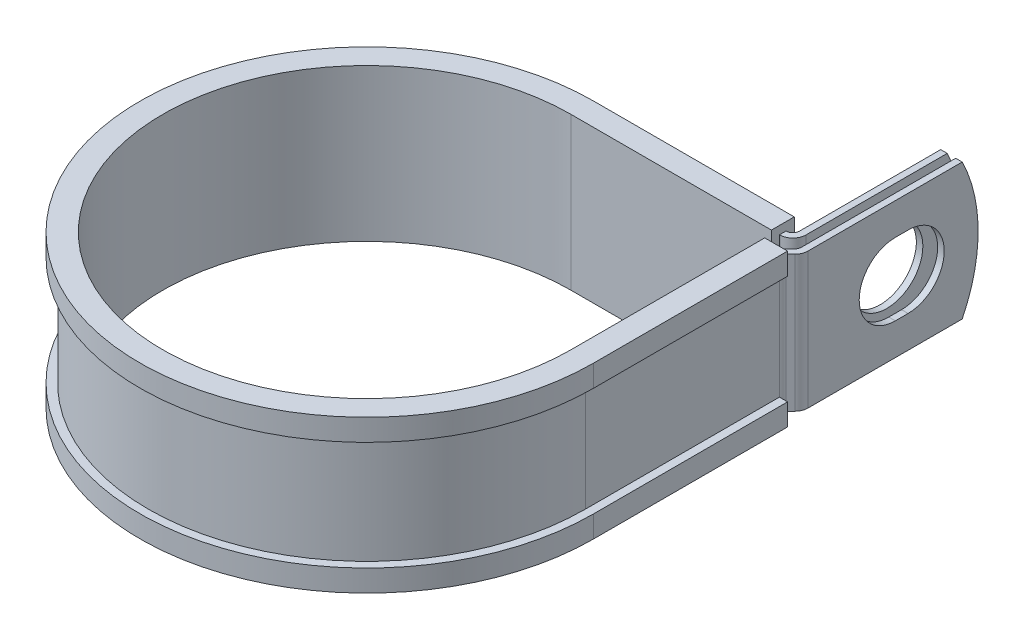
ISO-10303-21;
HEADER;
FILE_DESCRIPTION(('STEP AP214'),'2;1');
FILE_NAME('part.step','',(''),(''),'','','');
FILE_SCHEMA(('AUTOMOTIVE_DESIGN { 1 0 10303 214 1 1 1 1 }'));
ENDSEC;
DATA;
#1=APPLICATION_CONTEXT('core data for automotive mechanical design processes');
#2=APPLICATION_PROTOCOL_DEFINITION('international standard','automotive_design',2000,#1);
#3=PRODUCT_CONTEXT('',#1,'mechanical');
#4=PRODUCT('Part','Part','',(#3));
#5=PRODUCT_RELATED_PRODUCT_CATEGORY('part','',(#4));
#6=PRODUCT_DEFINITION_FORMATION('','',#4);
#7=PRODUCT_DEFINITION_CONTEXT('part definition',#1,'design');
#8=PRODUCT_DEFINITION('design','',#6,#7);
#9=PRODUCT_DEFINITION_SHAPE('','',#8);
#10=(LENGTH_UNIT() NAMED_UNIT(*) SI_UNIT(.MILLI.,.METRE.));
#11=(NAMED_UNIT(*) PLANE_ANGLE_UNIT() SI_UNIT($,.RADIAN.));
#12=(NAMED_UNIT(*) SI_UNIT($,.STERADIAN.) SOLID_ANGLE_UNIT());
#13=UNCERTAINTY_MEASURE_WITH_UNIT(LENGTH_MEASURE(1.E-05),#10,'distance_accuracy_value','');
#14=(GEOMETRIC_REPRESENTATION_CONTEXT(3) GLOBAL_UNCERTAINTY_ASSIGNED_CONTEXT((#13)) GLOBAL_UNIT_ASSIGNED_CONTEXT((#10,
#11,#12)) REPRESENTATION_CONTEXT('',''));
#15=CARTESIAN_POINT('',(0.,0.,0.));
#16=DIRECTION('',(0.,0.,1.));
#17=DIRECTION('',(1.,0.,0.));
#18=AXIS2_PLACEMENT_3D('',#15,#16,#17);
#19=CARTESIAN_POINT('',(40.3022698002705,-12.7,-39.624));
#20=DIRECTION('',(0.,1.,0.));
#21=DIRECTION('',(1.,0.,0.));
#22=AXIS2_PLACEMENT_3D('',#19,#20,#21);
#23=PLANE('',#22);
#24=DIRECTION('',(0.,0.,-1.));
#25=VECTOR('',#24,1.);
#26=CARTESIAN_POINT('',(37.457469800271,-12.7,-39.624));
#27=LINE('',#26,#25);
#28=CARTESIAN_POINT('',(37.457469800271,-12.7,-39.624));
#29=VERTEX_POINT('',#28);
#30=CARTESIAN_POINT('',(37.457469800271,-12.7,-40.8432));
#31=VERTEX_POINT('',#30);
#32=EDGE_CURVE('E524',#29,#31,#27,.T.);
#33=ORIENTED_EDGE('',*,*,#32,.T.);
#34=DIRECTION('',(1.,0.,0.));
#35=VECTOR('',#34,1.);
#36=CARTESIAN_POINT('',(0.,-12.7,-40.8432));
#37=LINE('',#36,#35);
#38=CARTESIAN_POINT('',(37.5082698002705,-12.7,-40.8432));
#39=VERTEX_POINT('',#38);
#40=EDGE_CURVE('E411',#39,#31,#37,.F.);
#41=ORIENTED_EDGE('',*,*,#40,.F.);
#42=CARTESIAN_POINT('',(37.5082698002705,-12.7,-42.0624));
#43=DIRECTION('',(0.,1.,0.));
#44=DIRECTION('',(1.,0.,0.));
#45=AXIS2_PLACEMENT_3D('',#42,#43,#44);
#46=CIRCLE('',#45,1.21919999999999);
#47=CARTESIAN_POINT('',(38.7274698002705,-12.7,-42.0624));
#48=VERTEX_POINT('',#47);
#49=EDGE_CURVE('E409',#48,#39,#46,.F.);
#50=ORIENTED_EDGE('',*,*,#49,.F.);
#51=DIRECTION('',(0.,0.,1.));
#52=VECTOR('',#51,1.);
#53=CARTESIAN_POINT('',(38.7274698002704,-12.7,-71.4248));
#54=LINE('',#53,#52);
#55=CARTESIAN_POINT('',(38.7274698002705,-12.7,-68.4474683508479));
#56=VERTEX_POINT('',#55);
#57=EDGE_CURVE('E407',#56,#48,#54,.T.);
#58=ORIENTED_EDGE('',*,*,#57,.F.);
#59=DIRECTION('',(-1.,0.,0.));
#60=VECTOR('',#59,1.);
#61=CARTESIAN_POINT('',(42.7406698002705,-12.7,-68.4474683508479));
#62=LINE('',#61,#60);
#63=CARTESIAN_POINT('',(39.9466698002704,-12.7,-68.4474683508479));
#64=VERTEX_POINT('',#63);
#65=EDGE_CURVE('E12',#64,#56,#62,.T.);
#66=ORIENTED_EDGE('',*,*,#65,.F.);
#67=DIRECTION('',(0.,0.,1.));
#68=VECTOR('',#67,1.);
#69=CARTESIAN_POINT('',(39.9466698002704,-12.7,-71.4248));
#70=LINE('',#69,#68);
#71=CARTESIAN_POINT('',(39.9466698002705,-12.7,-42.0624));
#72=VERTEX_POINT('',#71);
#73=EDGE_CURVE('E405',#64,#72,#70,.T.);
#74=ORIENTED_EDGE('',*,*,#73,.T.);
#75=CARTESIAN_POINT('',(37.5082698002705,-12.7,-42.0624));
#76=DIRECTION('',(0.,-1.,0.));
#77=DIRECTION('',(0.,0.,1.));
#78=AXIS2_PLACEMENT_3D('',#75,#76,#77);
#79=CIRCLE('',#78,2.43839999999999);
#80=CARTESIAN_POINT('',(37.5082698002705,-12.7,-39.624));
#81=VERTEX_POINT('',#80);
#82=EDGE_CURVE('E402',#72,#81,#79,.T.);
#83=ORIENTED_EDGE('',*,*,#82,.T.);
#84=DIRECTION('',(-1.,0.,0.));
#85=VECTOR('',#84,1.);
#86=CARTESIAN_POINT('',(0.,-12.7,-39.624));
#87=LINE('',#86,#85);
#88=EDGE_CURVE('E399',#81,#29,#87,.T.);
#89=ORIENTED_EDGE('',*,*,#88,.T.);
#90=EDGE_LOOP('',(#33,#41,#50,#58,#66,#74,#83,#89));
#91=FACE_BOUND('',#90,.T.);
#92=ADVANCED_FACE('F55',(#91),#23,.F.);
#93=CARTESIAN_POINT('',(40.3022698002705,12.7,-39.624));
#94=DIRECTION('',(0.,1.,0.));
#95=DIRECTION('',(1.,0.,0.));
#96=AXIS2_PLACEMENT_3D('',#93,#94,#95);
#97=PLANE('',#96);
#98=DIRECTION('',(1.,0.,0.));
#99=VECTOR('',#98,1.);
#100=CARTESIAN_POINT('',(0.,12.7,-40.8432));
#101=LINE('',#100,#99);
#102=CARTESIAN_POINT('',(37.5082698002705,12.7,-40.8432));
#103=VERTEX_POINT('',#102);
#104=CARTESIAN_POINT('',(37.457469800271,12.7,-40.8432));
#105=VERTEX_POINT('',#104);
#106=EDGE_CURVE('E369',#103,#105,#101,.F.);
#107=ORIENTED_EDGE('',*,*,#106,.T.);
#108=DIRECTION('',(0.,0.,1.));
#109=VECTOR('',#108,1.);
#110=CARTESIAN_POINT('',(37.457469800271,12.7,-40.8432));
#111=LINE('',#110,#109);
#112=CARTESIAN_POINT('',(37.457469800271,12.7,-39.624));
#113=VERTEX_POINT('',#112);
#114=EDGE_CURVE('E518',#105,#113,#111,.T.);
#115=ORIENTED_EDGE('',*,*,#114,.T.);
#116=DIRECTION('',(-1.,0.,0.));
#117=VECTOR('',#116,1.);
#118=CARTESIAN_POINT('',(0.,12.7,-39.624));
#119=LINE('',#118,#117);
#120=CARTESIAN_POINT('',(37.5082698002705,12.7,-39.624));
#121=VERTEX_POINT('',#120);
#122=EDGE_CURVE('E626',#121,#113,#119,.T.);
#123=ORIENTED_EDGE('',*,*,#122,.F.);
#124=CARTESIAN_POINT('',(37.5082698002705,12.7,-42.0624));
#125=DIRECTION('',(0.,-1.,0.));
#126=DIRECTION('',(0.,0.,1.));
#127=AXIS2_PLACEMENT_3D('',#124,#125,#126);
#128=CIRCLE('',#127,2.43839999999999);
#129=CARTESIAN_POINT('',(39.9466698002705,12.7,-42.0624));
#130=VERTEX_POINT('',#129);
#131=EDGE_CURVE('E371',#130,#121,#128,.T.);
#132=ORIENTED_EDGE('',*,*,#131,.F.);
#133=DIRECTION('',(0.,0.,1.));
#134=VECTOR('',#133,1.);
#135=CARTESIAN_POINT('',(39.9466698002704,12.7,-71.4248));
#136=LINE('',#135,#134);
#137=CARTESIAN_POINT('',(39.9466698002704,12.7,-68.4474683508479));
#138=VERTEX_POINT('',#137);
#139=EDGE_CURVE('E362',#138,#130,#136,.T.);
#140=ORIENTED_EDGE('',*,*,#139,.F.);
#141=DIRECTION('',(-1.,0.,0.));
#142=VECTOR('',#141,1.);
#143=CARTESIAN_POINT('',(42.7406698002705,12.7,-68.4474683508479));
#144=LINE('',#143,#142);
#145=CARTESIAN_POINT('',(38.7274698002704,12.7,-68.4474683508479));
#146=VERTEX_POINT('',#145);
#147=EDGE_CURVE('E63',#138,#146,#144,.T.);
#148=ORIENTED_EDGE('',*,*,#147,.T.);
#149=DIRECTION('',(0.,0.,1.));
#150=VECTOR('',#149,1.);
#151=CARTESIAN_POINT('',(38.7274698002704,12.7,-71.4248));
#152=LINE('',#151,#150);
#153=CARTESIAN_POINT('',(38.7274698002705,12.7,-42.0624));
#154=VERTEX_POINT('',#153);
#155=EDGE_CURVE('E359',#146,#154,#152,.T.);
#156=ORIENTED_EDGE('',*,*,#155,.T.);
#157=CARTESIAN_POINT('',(37.5082698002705,12.7,-42.0624));
#158=DIRECTION('',(0.,1.,0.));
#159=DIRECTION('',(1.,0.,0.));
#160=AXIS2_PLACEMENT_3D('',#157,#158,#159);
#161=CIRCLE('',#160,1.21919999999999);
#162=EDGE_CURVE('E367',#154,#103,#161,.F.);
#163=ORIENTED_EDGE('',*,*,#162,.T.);
#164=EDGE_LOOP('',(#107,#115,#123,#132,#140,#148,#156,#163));
#165=FACE_BOUND('',#164,.T.);
#166=ADVANCED_FACE('F358',(#165),#97,.T.);
#167=CARTESIAN_POINT('',(0.,12.7,-39.624));
#168=DIRECTION('',(0.,0.,1.));
#169=DIRECTION('',(1.,0.,0.));
#170=AXIS2_PLACEMENT_3D('',#167,#168,#169);
#171=PLANE('',#170);
#172=ORIENTED_EDGE('',*,*,#122,.T.);
#173=DIRECTION('',(0.,-1.,0.));
#174=VECTOR('',#173,1.);
#175=CARTESIAN_POINT('',(37.457469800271,12.7,-39.624));
#176=LINE('',#175,#174);
#177=EDGE_CURVE('E521',#113,#29,#176,.T.);
#178=ORIENTED_EDGE('',*,*,#177,.T.);
#179=ORIENTED_EDGE('',*,*,#88,.F.);
#180=DIRECTION('',(0.,-1.,0.));
#181=VECTOR('',#180,1.);
#182=CARTESIAN_POINT('',(37.5082698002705,12.7,-39.624));
#183=LINE('',#182,#181);
#184=EDGE_CURVE('E345',#121,#81,#183,.T.);
#185=ORIENTED_EDGE('',*,*,#184,.F.);
#186=EDGE_LOOP('',(#172,#178,#179,#185));
#187=FACE_BOUND('',#186,.T.);
#188=ADVANCED_FACE('F636',(#187),#171,.T.);
#189=CARTESIAN_POINT('',(42.7406698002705,12.7,-39.624));
#190=DIRECTION('',(-1.,0.,0.));
#191=DIRECTION('',(0.,0.,1.));
#192=AXIS2_PLACEMENT_3D('',#189,#190,#191);
#193=PLANE('',#192);
#194=CARTESIAN_POINT('',(42.7406698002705,0.,-58.3437999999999));
#195=DIRECTION('',(1.,0.,0.));
#196=DIRECTION('',(0.,0.,-1.));
#197=AXIS2_PLACEMENT_3D('',#194,#195,#196);
#198=CIRCLE('',#197,6.7437);
#199=CARTESIAN_POINT('',(42.7406698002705,-6.7437,-58.3438000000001));
#200=VERTEX_POINT('',#199);
#201=CARTESIAN_POINT('',(42.7406698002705,6.7437,-58.3438000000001));
#202=VERTEX_POINT('',#201);
#203=EDGE_CURVE('E581',#200,#202,#198,.T.);
#204=ORIENTED_EDGE('',*,*,#203,.F.);
#205=DIRECTION('',(0.,0.,-1.));
#206=VECTOR('',#205,1.);
#207=CARTESIAN_POINT('',(42.7406698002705,-6.7437,-55.9561999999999));
#208=LINE('',#207,#206);
#209=CARTESIAN_POINT('',(42.7406698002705,-6.7437,-55.9561999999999));
#210=VERTEX_POINT('',#209);
#211=EDGE_CURVE('E584',#210,#200,#208,.T.);
#212=ORIENTED_EDGE('',*,*,#211,.F.);
#213=CARTESIAN_POINT('',(42.7406698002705,0.,-55.9561999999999));
#214=DIRECTION('',(1.,0.,0.));
#215=DIRECTION('',(0.,0.,-1.));
#216=AXIS2_PLACEMENT_3D('',#213,#214,#215);
#217=CIRCLE('',#216,6.7437);
#218=CARTESIAN_POINT('',(42.7406698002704,6.7437,-55.9561999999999));
#219=VERTEX_POINT('',#218);
#220=EDGE_CURVE('E577',#219,#210,#217,.T.);
#221=ORIENTED_EDGE('',*,*,#220,.F.);
#222=DIRECTION('',(0.,0.,1.));
#223=VECTOR('',#222,1.);
#224=CARTESIAN_POINT('',(42.7406698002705,6.7437,-55.9561999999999));
#225=LINE('',#224,#223);
#226=EDGE_CURVE('E578',#202,#219,#225,.T.);
#227=ORIENTED_EDGE('',*,*,#226,.F.);
#228=EDGE_LOOP('',(#204,#212,#221,#227));
#229=FACE_BOUND('',#228,.T.);
#230=DIRECTION('',(0.,0.,-1.));
#231=VECTOR('',#230,1.);
#232=CARTESIAN_POINT('',(42.7406698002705,-12.7,-39.624));
#233=LINE('',#232,#231);
#234=CARTESIAN_POINT('',(42.7406698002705,-12.7,-39.624));
#235=VERTEX_POINT('',#234);
#236=CARTESIAN_POINT('',(42.7406698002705,-12.7,-68.4474683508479));
#237=VERTEX_POINT('',#236);
#238=EDGE_CURVE('E383',#235,#237,#233,.T.);
#239=ORIENTED_EDGE('',*,*,#238,.T.);
#240=CARTESIAN_POINT('',(42.7406698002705,0.,-42.8498));
#241=DIRECTION('',(-1.,0.,0.));
#242=DIRECTION('',(0.,0.,1.));
#243=AXIS2_PLACEMENT_3D('',#240,#241,#242);
#244=CIRCLE('',#243,28.575);
#245=CARTESIAN_POINT('',(42.7406698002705,12.7,-68.4474683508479));
#246=VERTEX_POINT('',#245);
#247=EDGE_CURVE('E569',#246,#237,#244,.T.);
#248=ORIENTED_EDGE('',*,*,#247,.F.);
#249=DIRECTION('',(0.,0.,-1.));
#250=VECTOR('',#249,1.);
#251=CARTESIAN_POINT('',(42.7406698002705,12.7,-39.624));
#252=LINE('',#251,#250);
#253=CARTESIAN_POINT('',(42.7406698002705,12.7,-39.624));
#254=VERTEX_POINT('',#253);
#255=EDGE_CURVE('E420',#254,#246,#252,.T.);
#256=ORIENTED_EDGE('',*,*,#255,.F.);
#257=DIRECTION('',(0.,-1.,0.));
#258=VECTOR('',#257,1.);
#259=CARTESIAN_POINT('',(42.7406698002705,12.7,-39.624));
#260=LINE('',#259,#258);
#261=EDGE_CURVE('E382',#254,#235,#260,.T.);
#262=ORIENTED_EDGE('',*,*,#261,.T.);
#263=EDGE_LOOP('',(#239,#248,#256,#262));
#264=FACE_BOUND('',#263,.T.);
#265=ADVANCED_FACE('F57',(#229,#264),#193,.F.);
#266=CARTESIAN_POINT('',(41.5214698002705,12.7,-39.624));
#267=DIRECTION('',(-1.,0.,0.));
#268=DIRECTION('',(0.,0.,1.));
#269=AXIS2_PLACEMENT_3D('',#266,#267,#268);
#270=PLANE('',#269);
#271=DIRECTION('',(0.,0.,-1.));
#272=VECTOR('',#271,1.);
#273=CARTESIAN_POINT('',(41.5214698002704,-6.7437,-55.9561999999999));
#274=LINE('',#273,#272);
#275=CARTESIAN_POINT('',(41.5214698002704,-6.7437,-55.9561999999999));
#276=VERTEX_POINT('',#275);
#277=CARTESIAN_POINT('',(41.5214698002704,-6.7437,-58.3438000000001));
#278=VERTEX_POINT('',#277);
#279=EDGE_CURVE('E580',#276,#278,#274,.T.);
#280=ORIENTED_EDGE('',*,*,#279,.T.);
#281=CARTESIAN_POINT('',(41.5214698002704,0.,-58.3437999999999));
#282=DIRECTION('',(-1.,0.,0.));
#283=DIRECTION('',(0.,0.,1.));
#284=AXIS2_PLACEMENT_3D('',#281,#282,#283);
#285=CIRCLE('',#284,6.7437);
#286=CARTESIAN_POINT('',(41.5214698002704,6.7437,-58.3438000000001));
#287=VERTEX_POINT('',#286);
#288=EDGE_CURVE('E601',#278,#287,#285,.F.);
#289=ORIENTED_EDGE('',*,*,#288,.T.);
#290=DIRECTION('',(0.,0.,1.));
#291=VECTOR('',#290,1.);
#292=CARTESIAN_POINT('',(41.5214698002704,6.7437,-55.9561999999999));
#293=LINE('',#292,#291);
#294=CARTESIAN_POINT('',(41.5214698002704,6.7437,-55.9561999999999));
#295=VERTEX_POINT('',#294);
#296=EDGE_CURVE('E597',#287,#295,#293,.T.);
#297=ORIENTED_EDGE('',*,*,#296,.T.);
#298=CARTESIAN_POINT('',(41.5214698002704,0.,-55.9561999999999));
#299=DIRECTION('',(-1.,0.,0.));
#300=DIRECTION('',(0.,0.,1.));
#301=AXIS2_PLACEMENT_3D('',#298,#299,#300);
#302=CIRCLE('',#301,6.7437);
#303=EDGE_CURVE('E592',#295,#276,#302,.F.);
#304=ORIENTED_EDGE('',*,*,#303,.T.);
#305=EDGE_LOOP('',(#280,#289,#297,#304));
#306=FACE_BOUND('',#305,.T.);
#307=CARTESIAN_POINT('',(41.5214698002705,0.,-42.8498));
#308=DIRECTION('',(-1.,0.,0.));
#309=DIRECTION('',(0.,0.,1.));
#310=AXIS2_PLACEMENT_3D('',#307,#308,#309);
#311=CIRCLE('',#310,28.575);
#312=CARTESIAN_POINT('',(41.5214698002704,12.7,-68.4474683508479));
#313=VERTEX_POINT('',#312);
#314=CARTESIAN_POINT('',(41.5214698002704,-12.7,-68.4474683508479));
#315=VERTEX_POINT('',#314);
#316=EDGE_CURVE('E77',#313,#315,#311,.T.);
#317=ORIENTED_EDGE('',*,*,#316,.T.);
#318=DIRECTION('',(0.,0.,-1.));
#319=VECTOR('',#318,1.);
#320=CARTESIAN_POINT('',(41.5214698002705,-12.7,-39.624));
#321=LINE('',#320,#319);
#322=CARTESIAN_POINT('',(41.5214698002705,-12.7,-39.624));
#323=VERTEX_POINT('',#322);
#324=EDGE_CURVE('E386',#323,#315,#321,.T.);
#325=ORIENTED_EDGE('',*,*,#324,.F.);
#326=DIRECTION('',(0.,-1.,0.));
#327=VECTOR('',#326,1.);
#328=CARTESIAN_POINT('',(41.5214698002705,12.7,-39.624));
#329=LINE('',#328,#327);
#330=CARTESIAN_POINT('',(41.5214698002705,12.7,-39.624));
#331=VERTEX_POINT('',#330);
#332=EDGE_CURVE('E353',#331,#323,#329,.T.);
#333=ORIENTED_EDGE('',*,*,#332,.F.);
#334=DIRECTION('',(0.,0.,-1.));
#335=VECTOR('',#334,1.);
#336=CARTESIAN_POINT('',(41.5214698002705,12.7,-39.624));
#337=LINE('',#336,#335);
#338=EDGE_CURVE('E616',#331,#313,#337,.T.);
#339=ORIENTED_EDGE('',*,*,#338,.T.);
#340=EDGE_LOOP('',(#317,#325,#333,#339));
#341=FACE_BOUND('',#340,.T.);
#342=ADVANCED_FACE('F690',(#306,#341),#270,.T.);
#343=CARTESIAN_POINT('',(39.9466698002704,12.7,-71.4248));
#344=DIRECTION('',(1.,0.,0.));
#345=DIRECTION('',(0.,0.,-1.));
#346=AXIS2_PLACEMENT_3D('',#343,#344,#345);
#347=PLANE('',#346);
#348=CARTESIAN_POINT('',(39.9466698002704,0.,-57.15));
#349=DIRECTION('',(1.,0.,0.));
#350=DIRECTION('',(0.,0.,-1.));
#351=AXIS2_PLACEMENT_3D('',#348,#349,#350);
#352=CIRCLE('',#351,6.7437);
#353=CARTESIAN_POINT('',(39.9466698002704,0.,-63.8937));
#354=VERTEX_POINT('',#353);
#355=EDGE_CURVE('E387',#354,#354,#352,.F.);
#356=ORIENTED_EDGE('',*,*,#355,.T.);
#357=EDGE_LOOP('',(#356));
#358=FACE_BOUND('',#357,.T.);
#359=ORIENTED_EDGE('',*,*,#73,.F.);
#360=CARTESIAN_POINT('',(39.9466698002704,0.,-42.8498));
#361=DIRECTION('',(1.,0.,0.));
#362=DIRECTION('',(0.,0.,-1.));
#363=AXIS2_PLACEMENT_3D('',#360,#361,#362);
#364=CIRCLE('',#363,28.575);
#365=EDGE_CURVE('E574',#64,#138,#364,.T.);
#366=ORIENTED_EDGE('',*,*,#365,.T.);
#367=ORIENTED_EDGE('',*,*,#139,.T.);
#368=DIRECTION('',(0.,-1.,0.));
#369=VECTOR('',#368,1.);
#370=CARTESIAN_POINT('',(39.9466698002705,12.7,-42.0624));
#371=LINE('',#370,#369);
#372=EDGE_CURVE('E342',#130,#72,#371,.T.);
#373=ORIENTED_EDGE('',*,*,#372,.T.);
#374=EDGE_LOOP('',(#359,#366,#367,#373));
#375=FACE_BOUND('',#374,.T.);
#376=ADVANCED_FACE('F642',(#358,#375),#347,.T.);
#377=CARTESIAN_POINT('',(38.7274698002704,12.7,-71.4248));
#378=DIRECTION('',(1.,0.,0.));
#379=DIRECTION('',(0.,0.,-1.));
#380=AXIS2_PLACEMENT_3D('',#377,#378,#379);
#381=PLANE('',#380);
#382=CARTESIAN_POINT('',(38.7274698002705,0.,-57.15));
#383=DIRECTION('',(-1.,0.,0.));
#384=DIRECTION('',(0.,0.,1.));
#385=AXIS2_PLACEMENT_3D('',#382,#383,#384);
#386=CIRCLE('',#385,6.7437);
#387=CARTESIAN_POINT('',(38.7274698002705,0.,-50.4063));
#388=VERTEX_POINT('',#387);
#389=EDGE_CURVE('E609',#388,#388,#386,.T.);
#390=ORIENTED_EDGE('',*,*,#389,.F.);
#391=EDGE_LOOP('',(#390));
#392=FACE_BOUND('',#391,.T.);
#393=CARTESIAN_POINT('',(38.7274698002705,0.,-42.8498));
#394=DIRECTION('',(-1.,0.,0.));
#395=DIRECTION('',(0.,0.,1.));
#396=AXIS2_PLACEMENT_3D('',#393,#394,#395);
#397=CIRCLE('',#396,28.575);
#398=EDGE_CURVE('E69',#146,#56,#397,.T.);
#399=ORIENTED_EDGE('',*,*,#398,.T.);
#400=ORIENTED_EDGE('',*,*,#57,.T.);
#401=DIRECTION('',(0.,-1.,0.));
#402=VECTOR('',#401,1.);
#403=CARTESIAN_POINT('',(38.7274698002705,12.7,-42.0624));
#404=LINE('',#403,#402);
#405=EDGE_CURVE('E339',#154,#48,#404,.T.);
#406=ORIENTED_EDGE('',*,*,#405,.F.);
#407=ORIENTED_EDGE('',*,*,#155,.F.);
#408=EDGE_LOOP('',(#399,#400,#406,#407));
#409=FACE_BOUND('',#408,.T.);
#410=ADVANCED_FACE('F365',(#392,#409),#381,.F.);
#411=CARTESIAN_POINT('',(42.0624,-12.7,-36.2115026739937));
#412=DIRECTION('',(0.,1.,0.));
#413=DIRECTION('',(1.,0.,0.));
#414=AXIS2_PLACEMENT_3D('',#411,#412,#413);
#415=CIRCLE('',#414,1.2192);
#416=CARTESIAN_POINT('',(40.8432,-12.7,-36.2115026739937));
#417=VERTEX_POINT('',#416);
#418=CARTESIAN_POINT('',(41.2002954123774,-12.7,-37.0736072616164));
#419=VERTEX_POINT('',#418);
#420=EDGE_CURVE('E414',#417,#419,#415,.F.);
#421=ORIENTED_EDGE('',*,*,#420,.F.);
#422=DIRECTION('',(1.,0.,0.));
#423=VECTOR('',#422,1.);
#424=CARTESIAN_POINT('',(39.624,-12.7,-36.2115026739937));
#425=LINE('',#424,#423);
#426=CARTESIAN_POINT('',(39.624,-12.7,-36.2115026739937));
#427=VERTEX_POINT('',#426);
#428=EDGE_CURVE('E452',#427,#417,#425,.T.);
#429=ORIENTED_EDGE('',*,*,#428,.F.);
#430=CARTESIAN_POINT('',(42.0624,-12.7,-36.2115026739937));
#431=DIRECTION('',(0.,-1.,0.));
#432=DIRECTION('',(0.,0.,1.));
#433=AXIS2_PLACEMENT_3D('',#430,#431,#432);
#434=CIRCLE('',#433,2.4384);
#435=CARTESIAN_POINT('',(40.3381908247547,-12.7,-37.935711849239));
#436=VERTEX_POINT('',#435);
#437=EDGE_CURVE('E396',#427,#436,#434,.T.);
#438=ORIENTED_EDGE('',*,*,#437,.T.);
#439=DIRECTION('',(0.707106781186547,0.,-0.707106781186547));
#440=VECTOR('',#439,1.);
#441=CARTESIAN_POINT('',(40.3381908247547,-12.7,-37.935711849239));
#442=LINE('',#441,#440);
#443=CARTESIAN_POINT('',(41.1643743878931,-12.7,-38.7618954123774));
#444=VERTEX_POINT('',#443);
#445=EDGE_CURVE('E393',#436,#444,#442,.T.);
#446=ORIENTED_EDGE('',*,*,#445,.T.);
#447=CARTESIAN_POINT('',(40.3022698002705,-12.7,-39.624));
#448=DIRECTION('',(0.,1.,0.));
#449=DIRECTION('',(0.,0.,1.));
#450=AXIS2_PLACEMENT_3D('',#447,#448,#449);
#451=CIRCLE('',#450,1.2192);
#452=EDGE_CURVE('E390',#444,#323,#451,.T.);
#453=ORIENTED_EDGE('',*,*,#452,.T.);
#454=ORIENTED_EDGE('',*,*,#324,.T.);
#455=DIRECTION('',(-1.,0.,0.));
#456=VECTOR('',#455,1.);
#457=CARTESIAN_POINT('',(42.7406698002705,-12.7,-68.4474683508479));
#458=LINE('',#457,#456);
#459=EDGE_CURVE('E567',#237,#315,#458,.T.);
#460=ORIENTED_EDGE('',*,*,#459,.F.);
#461=ORIENTED_EDGE('',*,*,#238,.F.);
#462=CARTESIAN_POINT('',(40.3022698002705,-12.7,-39.624));
#463=DIRECTION('',(0.,1.,0.));
#464=DIRECTION('',(1.,0.,0.));
#465=AXIS2_PLACEMENT_3D('',#462,#463,#464);
#466=CIRCLE('',#465,2.4384);
#467=CARTESIAN_POINT('',(42.0264789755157,-12.7,-37.8997908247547));
#468=VERTEX_POINT('',#467);
#469=EDGE_CURVE('E418',#468,#235,#466,.T.);
#470=ORIENTED_EDGE('',*,*,#469,.F.);
#471=DIRECTION('',(0.707106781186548,0.,-0.707106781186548));
#472=VECTOR('',#471,1.);
#473=CARTESIAN_POINT('',(41.2002954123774,-12.7,-37.0736072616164));
#474=LINE('',#473,#472);
#475=EDGE_CURVE('E416',#419,#468,#474,.T.);
#476=ORIENTED_EDGE('',*,*,#475,.F.);
#477=EDGE_LOOP('',(#421,#429,#438,#446,#453,#454,#460,#461,#470,#476));
#478=FACE_BOUND('',#477,.T.);
#479=ADVANCED_FACE('F676',(#478),#23,.F.);
#480=DIRECTION('',(-1.,0.,0.));
#481=VECTOR('',#480,1.);
#482=CARTESIAN_POINT('',(40.8432,12.7,-36.2115026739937));
#483=LINE('',#482,#481);
#484=CARTESIAN_POINT('',(40.8432,12.7,-36.2115026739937));
#485=VERTEX_POINT('',#484);
#486=CARTESIAN_POINT('',(39.624,12.7,-36.2115026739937));
#487=VERTEX_POINT('',#486);
#488=EDGE_CURVE('E441',#485,#487,#483,.T.);
#489=ORIENTED_EDGE('',*,*,#488,.F.);
#490=CARTESIAN_POINT('',(42.0624,12.7,-36.2115026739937));
#491=DIRECTION('',(0.,1.,0.));
#492=DIRECTION('',(1.,0.,0.));
#493=AXIS2_PLACEMENT_3D('',#490,#491,#492);
#494=CIRCLE('',#493,1.2192);
#495=CARTESIAN_POINT('',(41.2002954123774,12.7,-37.0736072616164));
#496=VERTEX_POINT('',#495);
#497=EDGE_CURVE('E376',#485,#496,#494,.F.);
#498=ORIENTED_EDGE('',*,*,#497,.T.);
#499=DIRECTION('',(0.707106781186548,0.,-0.707106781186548));
#500=VECTOR('',#499,1.);
#501=CARTESIAN_POINT('',(41.2002954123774,12.7,-37.0736072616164));
#502=LINE('',#501,#500);
#503=CARTESIAN_POINT('',(42.0264789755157,12.7,-37.8997908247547));
#504=VERTEX_POINT('',#503);
#505=EDGE_CURVE('E378',#496,#504,#502,.T.);
#506=ORIENTED_EDGE('',*,*,#505,.T.);
#507=CARTESIAN_POINT('',(40.3022698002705,12.7,-39.624));
#508=DIRECTION('',(0.,1.,0.));
#509=DIRECTION('',(1.,0.,0.));
#510=AXIS2_PLACEMENT_3D('',#507,#508,#509);
#511=CIRCLE('',#510,2.4384);
#512=EDGE_CURVE('E380',#504,#254,#511,.T.);
#513=ORIENTED_EDGE('',*,*,#512,.T.);
#514=ORIENTED_EDGE('',*,*,#255,.T.);
#515=DIRECTION('',(-1.,0.,0.));
#516=VECTOR('',#515,1.);
#517=CARTESIAN_POINT('',(42.7406698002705,12.7,-68.4474683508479));
#518=LINE('',#517,#516);
#519=EDGE_CURVE('E571',#246,#313,#518,.T.);
#520=ORIENTED_EDGE('',*,*,#519,.T.);
#521=ORIENTED_EDGE('',*,*,#338,.F.);
#522=CARTESIAN_POINT('',(40.3022698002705,12.7,-39.624));
#523=DIRECTION('',(0.,1.,0.));
#524=DIRECTION('',(0.,0.,1.));
#525=AXIS2_PLACEMENT_3D('',#522,#523,#524);
#526=CIRCLE('',#525,1.2192);
#527=CARTESIAN_POINT('',(41.1643743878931,12.7,-38.7618954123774));
#528=VERTEX_POINT('',#527);
#529=EDGE_CURVE('E619',#528,#331,#526,.T.);
#530=ORIENTED_EDGE('',*,*,#529,.F.);
#531=DIRECTION('',(0.707106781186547,0.,-0.707106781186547));
#532=VECTOR('',#531,1.);
#533=CARTESIAN_POINT('',(40.3381908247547,12.7,-37.935711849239));
#534=LINE('',#533,#532);
#535=CARTESIAN_POINT('',(40.3381908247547,12.7,-37.935711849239));
#536=VERTEX_POINT('',#535);
#537=EDGE_CURVE('E622',#536,#528,#534,.T.);
#538=ORIENTED_EDGE('',*,*,#537,.F.);
#539=CARTESIAN_POINT('',(42.0624,12.7,-36.2115026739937));
#540=DIRECTION('',(0.,-1.,0.));
#541=DIRECTION('',(0.,0.,1.));
#542=AXIS2_PLACEMENT_3D('',#539,#540,#541);
#543=CIRCLE('',#542,2.4384);
#544=EDGE_CURVE('E451',#487,#536,#543,.T.);
#545=ORIENTED_EDGE('',*,*,#544,.F.);
#546=EDGE_LOOP('',(#489,#498,#506,#513,#514,#520,#521,#530,#538,#545));
#547=FACE_BOUND('',#546,.T.);
#548=ADVANCED_FACE('F448',(#547),#97,.T.);
#549=CARTESIAN_POINT('',(40.3022698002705,12.7,-39.624));
#550=DIRECTION('',(0.,-1.,0.));
#551=DIRECTION('',(0.,0.,-1.));
#552=AXIS2_PLACEMENT_3D('',#549,#550,#551);
#553=CYLINDRICAL_SURFACE('',#552,1.2192);
#554=ORIENTED_EDGE('',*,*,#452,.F.);
#555=DIRECTION('',(0.,-1.,0.));
#556=VECTOR('',#555,1.);
#557=CARTESIAN_POINT('',(41.1643743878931,12.7,-38.7618954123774));
#558=LINE('',#557,#556);
#559=EDGE_CURVE('E351',#528,#444,#558,.T.);
#560=ORIENTED_EDGE('',*,*,#559,.F.);
#561=ORIENTED_EDGE('',*,*,#529,.T.);
#562=ORIENTED_EDGE('',*,*,#332,.T.);
#563=EDGE_LOOP('',(#554,#560,#561,#562));
#564=FACE_BOUND('',#563,.T.);
#565=ADVANCED_FACE('F686',(#564),#553,.F.);
#566=CARTESIAN_POINT('',(40.3381908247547,12.7,-37.935711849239));
#567=DIRECTION('',(-0.707106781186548,0.,-0.707106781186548));
#568=DIRECTION('',(-0.707106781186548,0.,0.707106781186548));
#569=AXIS2_PLACEMENT_3D('',#566,#567,#568);
#570=PLANE('',#569);
#571=ORIENTED_EDGE('',*,*,#445,.F.);
#572=DIRECTION('',(0.,-1.,0.));
#573=VECTOR('',#572,1.);
#574=CARTESIAN_POINT('',(40.3381908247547,12.7,-37.935711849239));
#575=LINE('',#574,#573);
#576=EDGE_CURVE('E349',#536,#436,#575,.T.);
#577=ORIENTED_EDGE('',*,*,#576,.F.);
#578=ORIENTED_EDGE('',*,*,#537,.T.);
#579=ORIENTED_EDGE('',*,*,#559,.T.);
#580=EDGE_LOOP('',(#571,#577,#578,#579));
#581=FACE_BOUND('',#580,.T.);
#582=ADVANCED_FACE('F681',(#581),#570,.T.);
#583=CARTESIAN_POINT('',(42.0624,12.7,-36.2115026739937));
#584=DIRECTION('',(0.,-1.,0.));
#585=DIRECTION('',(0.,0.,-1.));
#586=AXIS2_PLACEMENT_3D('',#583,#584,#585);
#587=CYLINDRICAL_SURFACE('',#586,2.4384);
#588=ORIENTED_EDGE('',*,*,#437,.F.);
#589=DIRECTION('',(0.,-1.,0.));
#590=VECTOR('',#589,1.);
#591=CARTESIAN_POINT('',(39.624,12.7,-36.2115026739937));
#592=LINE('',#591,#590);
#593=EDGE_CURVE('E347',#487,#427,#592,.T.);
#594=ORIENTED_EDGE('',*,*,#593,.F.);
#595=ORIENTED_EDGE('',*,*,#544,.T.);
#596=ORIENTED_EDGE('',*,*,#576,.T.);
#597=EDGE_LOOP('',(#588,#594,#595,#596));
#598=FACE_BOUND('',#597,.T.);
#599=ADVANCED_FACE('F678',(#598),#587,.T.);
#600=CARTESIAN_POINT('',(37.5082698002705,12.7,-42.0624));
#601=DIRECTION('',(0.,-1.,0.));
#602=DIRECTION('',(0.,0.,-1.));
#603=AXIS2_PLACEMENT_3D('',#600,#601,#602);
#604=CYLINDRICAL_SURFACE('',#603,2.43839999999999);
#605=ORIENTED_EDGE('',*,*,#82,.F.);
#606=ORIENTED_EDGE('',*,*,#372,.F.);
#607=ORIENTED_EDGE('',*,*,#131,.T.);
#608=ORIENTED_EDGE('',*,*,#184,.T.);
#609=EDGE_LOOP('',(#605,#606,#607,#608));
#610=FACE_BOUND('',#609,.T.);
#611=ADVANCED_FACE('F632',(#610),#604,.T.);
#612=CARTESIAN_POINT('',(37.5082698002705,12.7,-42.0624));
#613=DIRECTION('',(0.,-1.,0.));
#614=DIRECTION('',(0.,0.,-1.));
#615=AXIS2_PLACEMENT_3D('',#612,#613,#614);
#616=CYLINDRICAL_SURFACE('',#615,1.21919999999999);
#617=ORIENTED_EDGE('',*,*,#49,.T.);
#618=DIRECTION('',(0.,-1.,0.));
#619=VECTOR('',#618,1.);
#620=CARTESIAN_POINT('',(37.5082698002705,12.7,-40.8432));
#621=LINE('',#620,#619);
#622=EDGE_CURVE('E330',#103,#39,#621,.T.);
#623=ORIENTED_EDGE('',*,*,#622,.F.);
#624=ORIENTED_EDGE('',*,*,#162,.F.);
#625=ORIENTED_EDGE('',*,*,#405,.T.);
#626=EDGE_LOOP('',(#617,#623,#624,#625));
#627=FACE_BOUND('',#626,.T.);
#628=ADVANCED_FACE('F647',(#627),#616,.F.);
#629=CARTESIAN_POINT('',(0.,12.7,-40.8432));
#630=DIRECTION('',(0.,0.,1.));
#631=DIRECTION('',(1.,0.,0.));
#632=AXIS2_PLACEMENT_3D('',#629,#630,#631);
#633=PLANE('',#632);
#634=DIRECTION('',(0.,-1.,0.));
#635=VECTOR('',#634,1.);
#636=CARTESIAN_POINT('',(0.,12.7,-40.8432));
#637=LINE('',#636,#635);
#638=CARTESIAN_POINT('',(5.72914007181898E-13,10.16,-40.8432));
#639=VERTEX_POINT('',#638);
#640=CARTESIAN_POINT('',(5.72914007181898E-13,-10.16,-40.8432));
#641=VERTEX_POINT('',#640);
#642=EDGE_CURVE('E321',#639,#641,#637,.T.);
#643=ORIENTED_EDGE('',*,*,#642,.F.);
#644=DIRECTION('',(1.,0.,0.));
#645=VECTOR('',#644,1.);
#646=CARTESIAN_POINT('',(5.72914007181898E-13,10.16,-40.8432));
#647=LINE('',#646,#645);
#648=CARTESIAN_POINT('',(37.457469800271,10.16,-40.8432));
#649=VERTEX_POINT('',#648);
#650=EDGE_CURVE('E564',#639,#649,#647,.T.);
#651=ORIENTED_EDGE('',*,*,#650,.T.);
#652=DIRECTION('',(0.,1.,0.));
#653=VECTOR('',#652,1.);
#654=CARTESIAN_POINT('',(37.457469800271,12.7,-40.8432));
#655=LINE('',#654,#653);
#656=EDGE_CURVE('E515',#649,#105,#655,.T.);
#657=ORIENTED_EDGE('',*,*,#656,.T.);
#658=ORIENTED_EDGE('',*,*,#106,.F.);
#659=ORIENTED_EDGE('',*,*,#622,.T.);
#660=ORIENTED_EDGE('',*,*,#40,.T.);
#661=DIRECTION('',(0.,1.,0.));
#662=VECTOR('',#661,1.);
#663=CARTESIAN_POINT('',(37.457469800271,-12.7,-40.8432));
#664=LINE('',#663,#662);
#665=CARTESIAN_POINT('',(37.457469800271,-10.16,-40.8432));
#666=VERTEX_POINT('',#665);
#667=EDGE_CURVE('E527',#31,#666,#664,.T.);
#668=ORIENTED_EDGE('',*,*,#667,.T.);
#669=DIRECTION('',(1.,0.,0.));
#670=VECTOR('',#669,1.);
#671=CARTESIAN_POINT('',(5.72914007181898E-13,-10.16,-40.8432));
#672=LINE('',#671,#670);
#673=EDGE_CURVE('E544',#641,#666,#672,.T.);
#674=ORIENTED_EDGE('',*,*,#673,.F.);
#675=EDGE_LOOP('',(#643,#651,#657,#658,#659,#660,#668,#674));
#676=FACE_BOUND('',#675,.T.);
#677=ADVANCED_FACE('F651',(#676),#633,.F.);
#678=CARTESIAN_POINT('',(0.,12.7,0.));
#679=DIRECTION('',(0.,-1.,0.));
#680=DIRECTION('',(0.,0.,-1.));
#681=AXIS2_PLACEMENT_3D('',#678,#679,#680);
#682=CYLINDRICAL_SURFACE('',#681,40.8432);
#683=DIRECTION('',(0.,-1.,0.));
#684=VECTOR('',#683,1.);
#685=CARTESIAN_POINT('',(40.8432,12.7,0.));
#686=LINE('',#685,#684);
#687=CARTESIAN_POINT('',(40.8432,10.16,0.));
#688=VERTEX_POINT('',#687);
#689=CARTESIAN_POINT('',(40.8432,-10.16,0.));
#690=VERTEX_POINT('',#689);
#691=EDGE_CURVE('E319',#688,#690,#686,.T.);
#692=ORIENTED_EDGE('',*,*,#691,.F.);
#693=CARTESIAN_POINT('',(0.,10.16,0.));
#694=DIRECTION('',(0.,-1.,0.));
#695=DIRECTION('',(0.,0.,-1.));
#696=AXIS2_PLACEMENT_3D('',#693,#694,#695);
#697=CIRCLE('',#696,40.8432);
#698=EDGE_CURVE('E513',#688,#639,#697,.T.);
#699=ORIENTED_EDGE('',*,*,#698,.T.);
#700=ORIENTED_EDGE('',*,*,#642,.T.);
#701=CARTESIAN_POINT('',(0.,-10.16,0.));
#702=DIRECTION('',(0.,-1.,0.));
#703=DIRECTION('',(0.,0.,-1.));
#704=AXIS2_PLACEMENT_3D('',#701,#702,#703);
#705=CIRCLE('',#704,40.8432);
#706=EDGE_CURVE('E302',#690,#641,#705,.T.);
#707=ORIENTED_EDGE('',*,*,#706,.F.);
#708=EDGE_LOOP('',(#692,#699,#700,#707));
#709=FACE_BOUND('',#708,.T.);
#710=ADVANCED_FACE('F317',(#709),#682,.T.);
#711=CARTESIAN_POINT('',(40.8432,12.7,0.));
#712=DIRECTION('',(-1.,0.,0.));
#713=DIRECTION('',(0.,0.,1.));
#714=AXIS2_PLACEMENT_3D('',#711,#712,#713);
#715=PLANE('',#714);
#716=DIRECTION('',(0.,-1.,0.));
#717=VECTOR('',#716,1.);
#718=CARTESIAN_POINT('',(40.8432,12.7,-36.2115026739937));
#719=LINE('',#718,#717);
#720=CARTESIAN_POINT('',(40.8432,10.16,-36.2115026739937));
#721=VERTEX_POINT('',#720);
#722=CARTESIAN_POINT('',(40.8432,-10.16,-36.2115026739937));
#723=VERTEX_POINT('',#722);
#724=EDGE_CURVE('E333',#721,#723,#719,.T.);
#725=ORIENTED_EDGE('',*,*,#724,.F.);
#726=DIRECTION('',(0.,0.,-1.));
#727=VECTOR('',#726,1.);
#728=CARTESIAN_POINT('',(40.8432,10.16,0.));
#729=LINE('',#728,#727);
#730=EDGE_CURVE('E327',#688,#721,#729,.T.);
#731=ORIENTED_EDGE('',*,*,#730,.F.);
#732=ORIENTED_EDGE('',*,*,#691,.T.);
#733=DIRECTION('',(0.,0.,-1.));
#734=VECTOR('',#733,1.);
#735=CARTESIAN_POINT('',(40.8432,-10.16,0.));
#736=LINE('',#735,#734);
#737=EDGE_CURVE('E298',#690,#723,#736,.T.);
#738=ORIENTED_EDGE('',*,*,#737,.T.);
#739=EDGE_LOOP('',(#725,#731,#732,#738));
#740=FACE_BOUND('',#739,.T.);
#741=ADVANCED_FACE('F326',(#740),#715,.F.);
#742=CARTESIAN_POINT('',(42.0624,12.7,-36.2115026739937));
#743=DIRECTION('',(0.,-1.,0.));
#744=DIRECTION('',(0.,0.,-1.));
#745=AXIS2_PLACEMENT_3D('',#742,#743,#744);
#746=CYLINDRICAL_SURFACE('',#745,1.2192);
#747=ORIENTED_EDGE('',*,*,#420,.T.);
#748=DIRECTION('',(0.,-1.,0.));
#749=VECTOR('',#748,1.);
#750=CARTESIAN_POINT('',(41.2002954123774,12.7,-37.0736072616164));
#751=LINE('',#750,#749);
#752=EDGE_CURVE('E425',#496,#419,#751,.T.);
#753=ORIENTED_EDGE('',*,*,#752,.F.);
#754=ORIENTED_EDGE('',*,*,#497,.F.);
#755=EDGE_CURVE('E328',#485,#721,#719,.T.);
#756=ORIENTED_EDGE('',*,*,#755,.T.);
#757=ORIENTED_EDGE('',*,*,#724,.T.);
#758=DIRECTION('',(0.,1.,0.));
#759=VECTOR('',#758,1.);
#760=CARTESIAN_POINT('',(40.8432,-12.7,-36.2115026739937));
#761=LINE('',#760,#759);
#762=EDGE_CURVE('E434',#417,#723,#761,.T.);
#763=ORIENTED_EDGE('',*,*,#762,.F.);
#764=EDGE_LOOP('',(#747,#753,#754,#756,#757,#763));
#765=FACE_BOUND('',#764,.T.);
#766=ADVANCED_FACE('F433',(#765),#746,.F.);
#767=CARTESIAN_POINT('',(41.2002954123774,12.7,-37.0736072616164));
#768=DIRECTION('',(-0.707106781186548,0.,-0.707106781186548));
#769=DIRECTION('',(-0.707106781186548,0.,0.707106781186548));
#770=AXIS2_PLACEMENT_3D('',#767,#768,#769);
#771=PLANE('',#770);
#772=ORIENTED_EDGE('',*,*,#475,.T.);
#773=DIRECTION('',(0.,-1.,0.));
#774=VECTOR('',#773,1.);
#775=CARTESIAN_POINT('',(42.0264789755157,12.7,-37.8997908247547));
#776=LINE('',#775,#774);
#777=EDGE_CURVE('E423',#504,#468,#776,.T.);
#778=ORIENTED_EDGE('',*,*,#777,.F.);
#779=ORIENTED_EDGE('',*,*,#505,.F.);
#780=ORIENTED_EDGE('',*,*,#752,.T.);
#781=EDGE_LOOP('',(#772,#778,#779,#780));
#782=FACE_BOUND('',#781,.T.);
#783=ADVANCED_FACE('F702',(#782),#771,.F.);
#784=CARTESIAN_POINT('',(40.3022698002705,12.7,-39.624));
#785=DIRECTION('',(0.,-1.,0.));
#786=DIRECTION('',(0.,0.,-1.));
#787=AXIS2_PLACEMENT_3D('',#784,#785,#786);
#788=CYLINDRICAL_SURFACE('',#787,2.4384);
#789=ORIENTED_EDGE('',*,*,#469,.T.);
#790=ORIENTED_EDGE('',*,*,#261,.F.);
#791=ORIENTED_EDGE('',*,*,#512,.F.);
#792=ORIENTED_EDGE('',*,*,#777,.T.);
#793=EDGE_LOOP('',(#789,#790,#791,#792));
#794=FACE_BOUND('',#793,.T.);
#795=ADVANCED_FACE('F700',(#794),#788,.T.);
#796=CARTESIAN_POINT('',(59.0207338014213,0.,-57.15));
#797=DIRECTION('',(-1.,0.,0.));
#798=DIRECTION('',(0.,0.,1.));
#799=AXIS2_PLACEMENT_3D('',#796,#797,#798);
#800=CYLINDRICAL_SURFACE('',#799,6.7437);
#801=ORIENTED_EDGE('',*,*,#389,.T.);
#802=EDGE_LOOP('',(#801));
#803=FACE_BOUND('',#802,.T.);
#804=ORIENTED_EDGE('',*,*,#355,.F.);
#805=EDGE_LOOP('',(#804));
#806=FACE_BOUND('',#805,.T.);
#807=ADVANCED_FACE('F709',(#803,#806),#800,.F.);
#808=CARTESIAN_POINT('',(20.6905892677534,-6.7437,-55.9561999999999));
#809=DIRECTION('',(0.,-1.,0.));
#810=DIRECTION('',(0.,0.,-1.));
#811=AXIS2_PLACEMENT_3D('',#808,#809,#810);
#812=PLANE('',#811);
#813=DIRECTION('',(1.,0.,0.));
#814=VECTOR('',#813,1.);
#815=CARTESIAN_POINT('',(20.6905892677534,-6.7437,-55.9561999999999));
#816=LINE('',#815,#814);
#817=EDGE_CURVE('E595',#276,#210,#816,.T.);
#818=ORIENTED_EDGE('',*,*,#817,.T.);
#819=ORIENTED_EDGE('',*,*,#211,.T.);
#820=DIRECTION('',(1.,0.,0.));
#821=VECTOR('',#820,1.);
#822=CARTESIAN_POINT('',(20.6905892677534,-6.7437,-58.3438000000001));
#823=LINE('',#822,#821);
#824=EDGE_CURVE('E591',#278,#200,#823,.T.);
#825=ORIENTED_EDGE('',*,*,#824,.F.);
#826=ORIENTED_EDGE('',*,*,#279,.F.);
#827=EDGE_LOOP('',(#818,#819,#825,#826));
#828=FACE_BOUND('',#827,.T.);
#829=ADVANCED_FACE('F752',(#828),#812,.F.);
#830=CARTESIAN_POINT('',(20.6905892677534,0.,-58.3437999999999));
#831=DIRECTION('',(1.,0.,0.));
#832=DIRECTION('',(0.,0.,-1.));
#833=AXIS2_PLACEMENT_3D('',#830,#831,#832);
#834=CYLINDRICAL_SURFACE('',#833,6.7437);
#835=ORIENTED_EDGE('',*,*,#824,.T.);
#836=ORIENTED_EDGE('',*,*,#203,.T.);
#837=DIRECTION('',(1.,0.,0.));
#838=VECTOR('',#837,1.);
#839=CARTESIAN_POINT('',(20.6905892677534,6.7437,-58.3438000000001));
#840=LINE('',#839,#838);
#841=EDGE_CURVE('E600',#287,#202,#840,.T.);
#842=ORIENTED_EDGE('',*,*,#841,.F.);
#843=ORIENTED_EDGE('',*,*,#288,.F.);
#844=EDGE_LOOP('',(#835,#836,#842,#843));
#845=FACE_BOUND('',#844,.T.);
#846=ADVANCED_FACE('F756',(#845),#834,.F.);
#847=CARTESIAN_POINT('',(20.6905892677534,6.7437,-55.9561999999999));
#848=DIRECTION('',(0.,1.,0.));
#849=DIRECTION('',(0.,0.,1.));
#850=AXIS2_PLACEMENT_3D('',#847,#848,#849);
#851=PLANE('',#850);
#852=ORIENTED_EDGE('',*,*,#841,.T.);
#853=ORIENTED_EDGE('',*,*,#226,.T.);
#854=DIRECTION('',(1.,0.,0.));
#855=VECTOR('',#854,1.);
#856=CARTESIAN_POINT('',(20.6905892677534,6.7437,-55.9561999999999));
#857=LINE('',#856,#855);
#858=EDGE_CURVE('E596',#295,#219,#857,.T.);
#859=ORIENTED_EDGE('',*,*,#858,.F.);
#860=ORIENTED_EDGE('',*,*,#296,.F.);
#861=EDGE_LOOP('',(#852,#853,#859,#860));
#862=FACE_BOUND('',#861,.T.);
#863=ADVANCED_FACE('F760',(#862),#851,.F.);
#864=CARTESIAN_POINT('',(20.6905892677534,0.,-55.9561999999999));
#865=DIRECTION('',(1.,0.,0.));
#866=DIRECTION('',(0.,0.,-1.));
#867=AXIS2_PLACEMENT_3D('',#864,#865,#866);
#868=CYLINDRICAL_SURFACE('',#867,6.7437);
#869=ORIENTED_EDGE('',*,*,#858,.T.);
#870=ORIENTED_EDGE('',*,*,#220,.T.);
#871=ORIENTED_EDGE('',*,*,#817,.F.);
#872=ORIENTED_EDGE('',*,*,#303,.F.);
#873=EDGE_LOOP('',(#869,#870,#871,#872));
#874=FACE_BOUND('',#873,.T.);
#875=ADVANCED_FACE('F764',(#874),#868,.F.);
#876=CARTESIAN_POINT('',(42.7406698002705,0.,-42.8498));
#877=DIRECTION('',(-1.,0.,0.));
#878=DIRECTION('',(0.,0.,1.));
#879=AXIS2_PLACEMENT_3D('',#876,#877,#878);
#880=CYLINDRICAL_SURFACE('',#879,28.575);
#881=ORIENTED_EDGE('',*,*,#365,.F.);
#882=ORIENTED_EDGE('',*,*,#65,.T.);
#883=ORIENTED_EDGE('',*,*,#398,.F.);
#884=ORIENTED_EDGE('',*,*,#147,.F.);
#885=EDGE_LOOP('',(#881,#882,#883,#884));
#886=FACE_BOUND('',#885,.T.);
#887=ADVANCED_FACE('F643',(#886),#880,.T.);
#888=ORIENTED_EDGE('',*,*,#519,.F.);
#889=ORIENTED_EDGE('',*,*,#247,.T.);
#890=ORIENTED_EDGE('',*,*,#459,.T.);
#891=ORIENTED_EDGE('',*,*,#316,.F.);
#892=EDGE_LOOP('',(#888,#889,#890,#891));
#893=FACE_BOUND('',#892,.T.);
#894=ADVANCED_FACE('F691',(#893),#880,.T.);
#895=CARTESIAN_POINT('',(5.94291395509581E-13,14.224,-42.3672));
#896=DIRECTION('',(0.,0.,1.));
#897=DIRECTION('',(1.,0.,0.));
#898=AXIS2_PLACEMENT_3D('',#895,#896,#897);
#899=PLANE('',#898);
#900=DIRECTION('',(0.,-1.,0.));
#901=VECTOR('',#900,1.);
#902=CARTESIAN_POINT('',(5.94291395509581E-13,14.224,-42.3672));
#903=LINE('',#902,#901);
#904=CARTESIAN_POINT('',(5.94291395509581E-13,14.224,-42.3672));
#905=VERTEX_POINT('',#904);
#906=CARTESIAN_POINT('',(5.94291395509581E-13,10.16,-42.3672));
#907=VERTEX_POINT('',#906);
#908=EDGE_CURVE('E323',#905,#907,#903,.T.);
#909=ORIENTED_EDGE('',*,*,#908,.F.);
#910=DIRECTION('',(1.,0.,0.));
#911=VECTOR('',#910,1.);
#912=CARTESIAN_POINT('',(5.94291395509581E-13,14.224,-42.3672));
#913=LINE('',#912,#911);
#914=CARTESIAN_POINT('',(37.457469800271,14.224,-42.3672));
#915=VERTEX_POINT('',#914);
#916=EDGE_CURVE('E558',#905,#915,#913,.T.);
#917=ORIENTED_EDGE('',*,*,#916,.T.);
#918=DIRECTION('',(0.,-1.,0.));
#919=VECTOR('',#918,1.);
#920=CARTESIAN_POINT('',(37.457469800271,14.224,-42.3672));
#921=LINE('',#920,#919);
#922=CARTESIAN_POINT('',(37.457469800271,10.16,-42.3672));
#923=VERTEX_POINT('',#922);
#924=EDGE_CURVE('E540',#915,#923,#921,.T.);
#925=ORIENTED_EDGE('',*,*,#924,.T.);
#926=DIRECTION('',(1.,0.,0.));
#927=VECTOR('',#926,1.);
#928=CARTESIAN_POINT('',(5.94291395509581E-13,10.16,-42.3672));
#929=LINE('',#928,#927);
#930=EDGE_CURVE('E561',#907,#923,#929,.T.);
#931=ORIENTED_EDGE('',*,*,#930,.F.);
#932=EDGE_LOOP('',(#909,#917,#925,#931));
#933=FACE_BOUND('',#932,.T.);
#934=ADVANCED_FACE('F855',(#933),#899,.F.);
#935=CARTESIAN_POINT('',(5.34434708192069E-13,14.224,-38.1));
#936=DIRECTION('',(0.,0.,-1.));
#937=DIRECTION('',(0.,1.,0.));
#938=AXIS2_PLACEMENT_3D('',#935,#936,#937);
#939=PLANE('',#938);
#940=DIRECTION('',(0.,1.,0.));
#941=VECTOR('',#940,1.);
#942=CARTESIAN_POINT('',(5.34434708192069E-13,14.224,-38.1));
#943=LINE('',#942,#941);
#944=CARTESIAN_POINT('',(5.34434708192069E-13,-14.224,-38.1));
#945=VERTEX_POINT('',#944);
#946=CARTESIAN_POINT('',(5.34434708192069E-13,14.224,-38.1));
#947=VERTEX_POINT('',#946);
#948=EDGE_CURVE('E491',#945,#947,#943,.T.);
#949=ORIENTED_EDGE('',*,*,#948,.F.);
#950=DIRECTION('',(1.,0.,0.));
#951=VECTOR('',#950,1.);
#952=CARTESIAN_POINT('',(5.34434708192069E-13,-14.224,-38.1));
#953=LINE('',#952,#951);
#954=CARTESIAN_POINT('',(37.457469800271,-14.224,-38.1));
#955=VERTEX_POINT('',#954);
#956=EDGE_CURVE('E552',#945,#955,#953,.T.);
#957=ORIENTED_EDGE('',*,*,#956,.T.);
#958=DIRECTION('',(0.,1.,0.));
#959=VECTOR('',#958,1.);
#960=CARTESIAN_POINT('',(37.457469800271,14.224,-38.1));
#961=LINE('',#960,#959);
#962=CARTESIAN_POINT('',(37.457469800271,14.224,-38.1));
#963=VERTEX_POINT('',#962);
#964=EDGE_CURVE('E536',#955,#963,#961,.T.);
#965=ORIENTED_EDGE('',*,*,#964,.T.);
#966=DIRECTION('',(1.,0.,0.));
#967=VECTOR('',#966,1.);
#968=CARTESIAN_POINT('',(5.34434708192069E-13,14.224,-38.1));
#969=LINE('',#968,#967);
#970=EDGE_CURVE('E555',#947,#963,#969,.T.);
#971=ORIENTED_EDGE('',*,*,#970,.F.);
#972=EDGE_LOOP('',(#949,#957,#965,#971));
#973=FACE_BOUND('',#972,.T.);
#974=ADVANCED_FACE('F941',(#973),#939,.F.);
#975=CARTESIAN_POINT('',(5.94291395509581E-13,-14.224,-42.3672));
#976=DIRECTION('',(0.,0.,1.));
#977=DIRECTION('',(1.,0.,0.));
#978=AXIS2_PLACEMENT_3D('',#975,#976,#977);
#979=PLANE('',#978);
#980=DIRECTION('',(0.,-1.,0.));
#981=VECTOR('',#980,1.);
#982=CARTESIAN_POINT('',(5.94291395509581E-13,-14.224,-42.3672));
#983=LINE('',#982,#981);
#984=CARTESIAN_POINT('',(5.94291395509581E-13,-10.16,-42.3672));
#985=VERTEX_POINT('',#984);
#986=CARTESIAN_POINT('',(5.94291395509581E-13,-14.224,-42.3672));
#987=VERTEX_POINT('',#986);
#988=EDGE_CURVE('E477',#985,#987,#983,.T.);
#989=ORIENTED_EDGE('',*,*,#988,.F.);
#990=DIRECTION('',(1.,0.,0.));
#991=VECTOR('',#990,1.);
#992=CARTESIAN_POINT('',(5.94291395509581E-13,-10.16,-42.3672));
#993=LINE('',#992,#991);
#994=CARTESIAN_POINT('',(37.457469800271,-10.16,-42.3672));
#995=VERTEX_POINT('',#994);
#996=EDGE_CURVE('E546',#985,#995,#993,.T.);
#997=ORIENTED_EDGE('',*,*,#996,.T.);
#998=DIRECTION('',(0.,-1.,0.));
#999=VECTOR('',#998,1.);
#1000=CARTESIAN_POINT('',(37.457469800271,-14.224,-42.3672));
#1001=LINE('',#1000,#999);
#1002=CARTESIAN_POINT('',(37.457469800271,-14.224,-42.3672));
#1003=VERTEX_POINT('',#1002);
#1004=EDGE_CURVE('E532',#995,#1003,#1001,.T.);
#1005=ORIENTED_EDGE('',*,*,#1004,.T.);
#1006=DIRECTION('',(1.,0.,0.));
#1007=VECTOR('',#1006,1.);
#1008=CARTESIAN_POINT('',(5.94291395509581E-13,-14.224,-42.3672));
#1009=LINE('',#1008,#1007);
#1010=EDGE_CURVE('E549',#987,#1003,#1009,.T.);
#1011=ORIENTED_EDGE('',*,*,#1010,.F.);
#1012=EDGE_LOOP('',(#989,#997,#1005,#1011));
#1013=FACE_BOUND('',#1012,.T.);
#1014=ADVANCED_FACE('F662',(#1013),#979,.F.);
#1015=CARTESIAN_POINT('',(0.,12.7,0.));
#1016=DIRECTION('',(0.,-1.,0.));
#1017=DIRECTION('',(0.,0.,-1.));
#1018=AXIS2_PLACEMENT_3D('',#1015,#1016,#1017);
#1019=CYLINDRICAL_SURFACE('',#1018,42.3672);
#1020=DIRECTION('',(0.,-1.,0.));
#1021=VECTOR('',#1020,1.);
#1022=CARTESIAN_POINT('',(42.3672,14.224,0.));
#1023=LINE('',#1022,#1021);
#1024=CARTESIAN_POINT('',(42.3672,14.224,0.));
#1025=VERTEX_POINT('',#1024);
#1026=CARTESIAN_POINT('',(42.3672,10.16,0.));
#1027=VERTEX_POINT('',#1026);
#1028=EDGE_CURVE('E312',#1025,#1027,#1023,.T.);
#1029=ORIENTED_EDGE('',*,*,#1028,.F.);
#1030=CARTESIAN_POINT('',(0.,14.224,0.));
#1031=DIRECTION('',(0.,-1.,0.));
#1032=DIRECTION('',(0.,0.,-1.));
#1033=AXIS2_PLACEMENT_3D('',#1030,#1031,#1032);
#1034=CIRCLE('',#1033,42.3672);
#1035=EDGE_CURVE('E507',#1025,#905,#1034,.T.);
#1036=ORIENTED_EDGE('',*,*,#1035,.T.);
#1037=ORIENTED_EDGE('',*,*,#908,.T.);
#1038=CARTESIAN_POINT('',(0.,10.16,0.));
#1039=DIRECTION('',(0.,-1.,0.));
#1040=DIRECTION('',(0.,0.,-1.));
#1041=AXIS2_PLACEMENT_3D('',#1038,#1039,#1040);
#1042=CIRCLE('',#1041,42.3672);
#1043=EDGE_CURVE('E510',#1027,#907,#1042,.T.);
#1044=ORIENTED_EDGE('',*,*,#1043,.F.);
#1045=EDGE_LOOP('',(#1029,#1036,#1037,#1044));
#1046=FACE_BOUND('',#1045,.T.);
#1047=ADVANCED_FACE('F961',(#1046),#1019,.T.);
#1048=CARTESIAN_POINT('',(0.,12.7,0.));
#1049=DIRECTION('',(0.,-1.,0.));
#1050=DIRECTION('',(0.,0.,-1.));
#1051=AXIS2_PLACEMENT_3D('',#1048,#1049,#1050);
#1052=CYLINDRICAL_SURFACE('',#1051,38.1);
#1053=DIRECTION('',(0.,1.,0.));
#1054=VECTOR('',#1053,1.);
#1055=CARTESIAN_POINT('',(38.1,14.224,0.));
#1056=LINE('',#1055,#1054);
#1057=CARTESIAN_POINT('',(38.1,-14.224,0.));
#1058=VERTEX_POINT('',#1057);
#1059=CARTESIAN_POINT('',(38.1,14.224,0.));
#1060=VERTEX_POINT('',#1059);
#1061=EDGE_CURVE('E1124',#1058,#1060,#1056,.T.);
#1062=ORIENTED_EDGE('',*,*,#1061,.F.);
#1063=CARTESIAN_POINT('',(0.,-14.224,0.));
#1064=DIRECTION('',(0.,-1.,0.));
#1065=DIRECTION('',(0.,0.,-1.));
#1066=AXIS2_PLACEMENT_3D('',#1063,#1064,#1065);
#1067=CIRCLE('',#1066,38.1);
#1068=EDGE_CURVE('E501',#1058,#945,#1067,.T.);
#1069=ORIENTED_EDGE('',*,*,#1068,.T.);
#1070=ORIENTED_EDGE('',*,*,#948,.T.);
#1071=CARTESIAN_POINT('',(0.,14.224,0.));
#1072=DIRECTION('',(0.,-1.,0.));
#1073=DIRECTION('',(0.,0.,-1.));
#1074=AXIS2_PLACEMENT_3D('',#1071,#1072,#1073);
#1075=CIRCLE('',#1074,38.1);
#1076=EDGE_CURVE('E504',#1060,#947,#1075,.T.);
#1077=ORIENTED_EDGE('',*,*,#1076,.F.);
#1078=EDGE_LOOP('',(#1062,#1069,#1070,#1077));
#1079=FACE_BOUND('',#1078,.T.);
#1080=ADVANCED_FACE('F971',(#1079),#1052,.F.);
#1081=CARTESIAN_POINT('',(0.,12.7,0.));
#1082=DIRECTION('',(0.,-1.,0.));
#1083=DIRECTION('',(0.,0.,-1.));
#1084=AXIS2_PLACEMENT_3D('',#1081,#1082,#1083);
#1085=CYLINDRICAL_SURFACE('',#1084,42.3672);
#1086=DIRECTION('',(0.,-1.,0.));
#1087=VECTOR('',#1086,1.);
#1088=CARTESIAN_POINT('',(42.3672,-14.224,0.));
#1089=LINE('',#1088,#1087);
#1090=CARTESIAN_POINT('',(42.3672,-10.16,0.));
#1091=VERTEX_POINT('',#1090);
#1092=CARTESIAN_POINT('',(42.3672,-14.224,0.));
#1093=VERTEX_POINT('',#1092);
#1094=EDGE_CURVE('E475',#1091,#1093,#1089,.T.);
#1095=ORIENTED_EDGE('',*,*,#1094,.F.);
#1096=CARTESIAN_POINT('',(0.,-10.16,0.));
#1097=DIRECTION('',(0.,-1.,0.));
#1098=DIRECTION('',(0.,0.,-1.));
#1099=AXIS2_PLACEMENT_3D('',#1096,#1097,#1098);
#1100=CIRCLE('',#1099,42.3672);
#1101=EDGE_CURVE('E322',#1091,#985,#1100,.T.);
#1102=ORIENTED_EDGE('',*,*,#1101,.T.);
#1103=ORIENTED_EDGE('',*,*,#988,.T.);
#1104=CARTESIAN_POINT('',(0.,-14.224,0.));
#1105=DIRECTION('',(0.,-1.,0.));
#1106=DIRECTION('',(0.,0.,-1.));
#1107=AXIS2_PLACEMENT_3D('',#1104,#1105,#1106);
#1108=CIRCLE('',#1107,42.3672);
#1109=EDGE_CURVE('E498',#1093,#987,#1108,.T.);
#1110=ORIENTED_EDGE('',*,*,#1109,.F.);
#1111=EDGE_LOOP('',(#1095,#1102,#1103,#1110));
#1112=FACE_BOUND('',#1111,.T.);
#1113=ADVANCED_FACE('F665',(#1112),#1085,.T.);
#1114=CARTESIAN_POINT('',(42.3672,10.16,0.));
#1115=DIRECTION('',(0.,-1.,0.));
#1116=DIRECTION('',(0.,0.,-1.));
#1117=AXIS2_PLACEMENT_3D('',#1114,#1115,#1116);
#1118=PLANE('',#1117);
#1119=DIRECTION('',(-1.,0.,0.));
#1120=VECTOR('',#1119,1.);
#1121=CARTESIAN_POINT('',(42.3672,10.16,-36.2115026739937));
#1122=LINE('',#1121,#1120);
#1123=CARTESIAN_POINT('',(42.3672,10.16,-36.2115026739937));
#1124=VERTEX_POINT('',#1123);
#1125=EDGE_CURVE('E445',#1124,#721,#1122,.T.);
#1126=ORIENTED_EDGE('',*,*,#1125,.F.);
#1127=DIRECTION('',(0.,0.,-1.));
#1128=VECTOR('',#1127,1.);
#1129=CARTESIAN_POINT('',(42.3672,10.16,0.));
#1130=LINE('',#1129,#1128);
#1131=EDGE_CURVE('E478',#1027,#1124,#1130,.T.);
#1132=ORIENTED_EDGE('',*,*,#1131,.F.);
#1133=ORIENTED_EDGE('',*,*,#1043,.T.);
#1134=ORIENTED_EDGE('',*,*,#930,.T.);
#1135=DIRECTION('',(0.,0.,1.));
#1136=VECTOR('',#1135,1.);
#1137=CARTESIAN_POINT('',(37.457469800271,10.16,-42.3672));
#1138=LINE('',#1137,#1136);
#1139=EDGE_CURVE('E542',#923,#649,#1138,.T.);
#1140=ORIENTED_EDGE('',*,*,#1139,.T.);
#1141=ORIENTED_EDGE('',*,*,#650,.F.);
#1142=ORIENTED_EDGE('',*,*,#698,.F.);
#1143=ORIENTED_EDGE('',*,*,#730,.T.);
#1144=EDGE_LOOP('',(#1126,#1132,#1133,#1134,#1140,#1141,#1142,#1143));
#1145=FACE_BOUND('',#1144,.T.);
#1146=ADVANCED_FACE('F992',(#1145),#1118,.T.);
#1147=CARTESIAN_POINT('',(42.3672,14.224,0.));
#1148=DIRECTION('',(1.,0.,0.));
#1149=DIRECTION('',(0.,0.,-1.));
#1150=AXIS2_PLACEMENT_3D('',#1147,#1148,#1149);
#1151=PLANE('',#1150);
#1152=DIRECTION('',(0.,-1.,0.));
#1153=VECTOR('',#1152,1.);
#1154=CARTESIAN_POINT('',(42.3672,14.224,-36.2115026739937));
#1155=LINE('',#1154,#1153);
#1156=CARTESIAN_POINT('',(42.3672,14.224,-36.2115026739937));
#1157=VERTEX_POINT('',#1156);
#1158=EDGE_CURVE('E472',#1157,#1124,#1155,.T.);
#1159=ORIENTED_EDGE('',*,*,#1158,.F.);
#1160=DIRECTION('',(0.,0.,-1.));
#1161=VECTOR('',#1160,1.);
#1162=CARTESIAN_POINT('',(42.3672,14.224,0.));
#1163=LINE('',#1162,#1161);
#1164=EDGE_CURVE('E480',#1025,#1157,#1163,.T.);
#1165=ORIENTED_EDGE('',*,*,#1164,.F.);
#1166=ORIENTED_EDGE('',*,*,#1028,.T.);
#1167=ORIENTED_EDGE('',*,*,#1131,.T.);
#1168=EDGE_LOOP('',(#1159,#1165,#1166,#1167));
#1169=FACE_BOUND('',#1168,.T.);
#1170=ADVANCED_FACE('F1003',(#1169),#1151,.T.);
#1171=CARTESIAN_POINT('',(42.3672,14.224,0.));
#1172=DIRECTION('',(0.,1.,0.));
#1173=DIRECTION('',(0.,0.,1.));
#1174=AXIS2_PLACEMENT_3D('',#1171,#1172,#1173);
#1175=PLANE('',#1174);
#1176=DIRECTION('',(1.,0.,0.));
#1177=VECTOR('',#1176,1.);
#1178=CARTESIAN_POINT('',(42.3672,14.224,-36.2115026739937));
#1179=LINE('',#1178,#1177);
#1180=CARTESIAN_POINT('',(38.1,14.224,-36.2115026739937));
#1181=VERTEX_POINT('',#1180);
#1182=EDGE_CURVE('E469',#1181,#1157,#1179,.T.);
#1183=ORIENTED_EDGE('',*,*,#1182,.F.);
#1184=DIRECTION('',(0.,0.,-1.));
#1185=VECTOR('',#1184,1.);
#1186=CARTESIAN_POINT('',(38.1,14.224,0.));
#1187=LINE('',#1186,#1185);
#1188=EDGE_CURVE('E482',#1060,#1181,#1187,.T.);
#1189=ORIENTED_EDGE('',*,*,#1188,.F.);
#1190=ORIENTED_EDGE('',*,*,#1076,.T.);
#1191=ORIENTED_EDGE('',*,*,#970,.T.);
#1192=DIRECTION('',(0.,0.,-1.));
#1193=VECTOR('',#1192,1.);
#1194=CARTESIAN_POINT('',(37.457469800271,14.224,-42.3672));
#1195=LINE('',#1194,#1193);
#1196=EDGE_CURVE('E538',#963,#915,#1195,.T.);
#1197=ORIENTED_EDGE('',*,*,#1196,.T.);
#1198=ORIENTED_EDGE('',*,*,#916,.F.);
#1199=ORIENTED_EDGE('',*,*,#1035,.F.);
#1200=ORIENTED_EDGE('',*,*,#1164,.T.);
#1201=EDGE_LOOP('',(#1183,#1189,#1190,#1191,#1197,#1198,#1199,#1200));
#1202=FACE_BOUND('',#1201,.T.);
#1203=ADVANCED_FACE('F1015',(#1202),#1175,.T.);
#1204=CARTESIAN_POINT('',(38.1,14.224,0.));
#1205=DIRECTION('',(-1.,0.,0.));
#1206=DIRECTION('',(0.,-1.,0.));
#1207=AXIS2_PLACEMENT_3D('',#1204,#1205,#1206);
#1208=PLANE('',#1207);
#1209=DIRECTION('',(0.,1.,0.));
#1210=VECTOR('',#1209,1.);
#1211=CARTESIAN_POINT('',(38.1,14.224,-36.2115026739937));
#1212=LINE('',#1211,#1210);
#1213=CARTESIAN_POINT('',(38.1,-14.224,-36.2115026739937));
#1214=VERTEX_POINT('',#1213);
#1215=EDGE_CURVE('E466',#1214,#1181,#1212,.T.);
#1216=ORIENTED_EDGE('',*,*,#1215,.F.);
#1217=DIRECTION('',(0.,0.,-1.));
#1218=VECTOR('',#1217,1.);
#1219=CARTESIAN_POINT('',(38.1,-14.224,0.));
#1220=LINE('',#1219,#1218);
#1221=EDGE_CURVE('E484',#1058,#1214,#1220,.T.);
#1222=ORIENTED_EDGE('',*,*,#1221,.F.);
#1223=ORIENTED_EDGE('',*,*,#1061,.T.);
#1224=ORIENTED_EDGE('',*,*,#1188,.T.);
#1225=EDGE_LOOP('',(#1216,#1222,#1223,#1224));
#1226=FACE_BOUND('',#1225,.T.);
#1227=ADVANCED_FACE('F1027',(#1226),#1208,.T.);
#1228=CARTESIAN_POINT('',(38.1,-14.224,0.));
#1229=DIRECTION('',(0.,-1.,0.));
#1230=DIRECTION('',(0.,0.,-1.));
#1231=AXIS2_PLACEMENT_3D('',#1228,#1229,#1230);
#1232=PLANE('',#1231);
#1233=DIRECTION('',(-1.,0.,0.));
#1234=VECTOR('',#1233,1.);
#1235=CARTESIAN_POINT('',(38.1,-14.224,-36.2115026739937));
#1236=LINE('',#1235,#1234);
#1237=CARTESIAN_POINT('',(42.3672,-14.224,-36.2115026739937));
#1238=VERTEX_POINT('',#1237);
#1239=EDGE_CURVE('E463',#1238,#1214,#1236,.T.);
#1240=ORIENTED_EDGE('',*,*,#1239,.F.);
#1241=DIRECTION('',(0.,0.,-1.));
#1242=VECTOR('',#1241,1.);
#1243=CARTESIAN_POINT('',(42.3672,-14.224,0.));
#1244=LINE('',#1243,#1242);
#1245=EDGE_CURVE('E486',#1093,#1238,#1244,.T.);
#1246=ORIENTED_EDGE('',*,*,#1245,.F.);
#1247=ORIENTED_EDGE('',*,*,#1109,.T.);
#1248=ORIENTED_EDGE('',*,*,#1010,.T.);
#1249=DIRECTION('',(0.,0.,1.));
#1250=VECTOR('',#1249,1.);
#1251=CARTESIAN_POINT('',(37.457469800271,-14.224,-38.1));
#1252=LINE('',#1251,#1250);
#1253=EDGE_CURVE('E534',#1003,#955,#1252,.T.);
#1254=ORIENTED_EDGE('',*,*,#1253,.T.);
#1255=ORIENTED_EDGE('',*,*,#956,.F.);
#1256=ORIENTED_EDGE('',*,*,#1068,.F.);
#1257=ORIENTED_EDGE('',*,*,#1221,.T.);
#1258=EDGE_LOOP('',(#1240,#1246,#1247,#1248,#1254,#1255,#1256,#1257));
#1259=FACE_BOUND('',#1258,.T.);
#1260=ADVANCED_FACE('F1039',(#1259),#1232,.T.);
#1261=CARTESIAN_POINT('',(42.3672,-14.224,0.));
#1262=DIRECTION('',(1.,0.,0.));
#1263=DIRECTION('',(0.,0.,-1.));
#1264=AXIS2_PLACEMENT_3D('',#1261,#1262,#1263);
#1265=PLANE('',#1264);
#1266=DIRECTION('',(0.,-1.,0.));
#1267=VECTOR('',#1266,1.);
#1268=CARTESIAN_POINT('',(42.3672,-14.224,-36.2115026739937));
#1269=LINE('',#1268,#1267);
#1270=CARTESIAN_POINT('',(42.3672,-10.16,-36.2115026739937));
#1271=VERTEX_POINT('',#1270);
#1272=EDGE_CURVE('E460',#1271,#1238,#1269,.T.);
#1273=ORIENTED_EDGE('',*,*,#1272,.F.);
#1274=DIRECTION('',(0.,0.,-1.));
#1275=VECTOR('',#1274,1.);
#1276=CARTESIAN_POINT('',(42.3672,-10.16,0.));
#1277=LINE('',#1276,#1275);
#1278=EDGE_CURVE('E311',#1091,#1271,#1277,.T.);
#1279=ORIENTED_EDGE('',*,*,#1278,.F.);
#1280=ORIENTED_EDGE('',*,*,#1094,.T.);
#1281=ORIENTED_EDGE('',*,*,#1245,.T.);
#1282=EDGE_LOOP('',(#1273,#1279,#1280,#1281));
#1283=FACE_BOUND('',#1282,.T.);
#1284=ADVANCED_FACE('F670',(#1283),#1265,.T.);
#1285=CARTESIAN_POINT('',(40.8432,-10.16,0.));
#1286=DIRECTION('',(0.,1.,0.));
#1287=DIRECTION('',(0.,0.,1.));
#1288=AXIS2_PLACEMENT_3D('',#1285,#1286,#1287);
#1289=PLANE('',#1288);
#1290=DIRECTION('',(1.,0.,0.));
#1291=VECTOR('',#1290,1.);
#1292=CARTESIAN_POINT('',(40.8432,-10.16,-36.2115026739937));
#1293=LINE('',#1292,#1291);
#1294=EDGE_CURVE('E305',#723,#1271,#1293,.T.);
#1295=ORIENTED_EDGE('',*,*,#1294,.F.);
#1296=ORIENTED_EDGE('',*,*,#737,.F.);
#1297=ORIENTED_EDGE('',*,*,#706,.T.);
#1298=ORIENTED_EDGE('',*,*,#673,.T.);
#1299=DIRECTION('',(0.,0.,-1.));
#1300=VECTOR('',#1299,1.);
#1301=CARTESIAN_POINT('',(37.457469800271,-10.16,-40.8432));
#1302=LINE('',#1301,#1300);
#1303=EDGE_CURVE('E530',#666,#995,#1302,.T.);
#1304=ORIENTED_EDGE('',*,*,#1303,.T.);
#1305=ORIENTED_EDGE('',*,*,#996,.F.);
#1306=ORIENTED_EDGE('',*,*,#1101,.F.);
#1307=ORIENTED_EDGE('',*,*,#1278,.T.);
#1308=EDGE_LOOP('',(#1295,#1296,#1297,#1298,#1304,#1305,#1306,#1307));
#1309=FACE_BOUND('',#1308,.T.);
#1310=ADVANCED_FACE('F300',(#1309),#1289,.T.);
#1311=CARTESIAN_POINT('',(37.4574698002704,0.,0.));
#1312=DIRECTION('',(-1.,0.,0.));
#1313=DIRECTION('',(0.,0.,1.));
#1314=AXIS2_PLACEMENT_3D('',#1311,#1312,#1313);
#1315=PLANE('',#1314);
#1316=ORIENTED_EDGE('',*,*,#656,.F.);
#1317=ORIENTED_EDGE('',*,*,#1139,.F.);
#1318=ORIENTED_EDGE('',*,*,#924,.F.);
#1319=ORIENTED_EDGE('',*,*,#1196,.F.);
#1320=ORIENTED_EDGE('',*,*,#964,.F.);
#1321=ORIENTED_EDGE('',*,*,#1253,.F.);
#1322=ORIENTED_EDGE('',*,*,#1004,.F.);
#1323=ORIENTED_EDGE('',*,*,#1303,.F.);
#1324=ORIENTED_EDGE('',*,*,#667,.F.);
#1325=ORIENTED_EDGE('',*,*,#32,.F.);
#1326=ORIENTED_EDGE('',*,*,#177,.F.);
#1327=ORIENTED_EDGE('',*,*,#114,.F.);
#1328=EDGE_LOOP('',(#1316,#1317,#1318,#1319,#1320,#1321,#1322,#1323,#1324,#1325,#1326,#1327));
#1329=FACE_BOUND('',#1328,.T.);
#1330=ADVANCED_FACE('F655',(#1329),#1315,.F.);
#1331=CARTESIAN_POINT('',(0.,0.,-36.2115026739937));
#1332=DIRECTION('',(0.,0.,-1.));
#1333=DIRECTION('',(-1.,0.,0.));
#1334=AXIS2_PLACEMENT_3D('',#1331,#1332,#1333);
#1335=PLANE('',#1334);
#1336=ORIENTED_EDGE('',*,*,#755,.F.);
#1337=ORIENTED_EDGE('',*,*,#488,.T.);
#1338=ORIENTED_EDGE('',*,*,#593,.T.);
#1339=ORIENTED_EDGE('',*,*,#428,.T.);
#1340=ORIENTED_EDGE('',*,*,#762,.T.);
#1341=ORIENTED_EDGE('',*,*,#1294,.T.);
#1342=ORIENTED_EDGE('',*,*,#1272,.T.);
#1343=ORIENTED_EDGE('',*,*,#1239,.T.);
#1344=ORIENTED_EDGE('',*,*,#1215,.T.);
#1345=ORIENTED_EDGE('',*,*,#1182,.T.);
#1346=ORIENTED_EDGE('',*,*,#1158,.T.);
#1347=ORIENTED_EDGE('',*,*,#1125,.T.);
#1348=EDGE_LOOP('',(#1336,#1337,#1338,#1339,#1340,#1341,#1342,#1343,#1344,#1345,#1346,#1347));
#1349=FACE_BOUND('',#1348,.T.);
#1350=ADVANCED_FACE('F440',(#1349),#1335,.T.);
#1351=CLOSED_SHELL('',(#92,#166,#188,#265,#342,#376,#410,#479,#548,#565,#582,#599,#611,#628,
#677,#710,#741,#766,#783,#795,#807,#829,#846,#863,#875,#887,#894,#934,#974,#1014,#1047,#1080,
#1113,#1146,#1170,#1203,#1227,#1260,#1284,#1310,#1330,#1350));
#1352=MANIFOLD_SOLID_BREP('B2',#1351);
#1353=ADVANCED_BREP_SHAPE_REPRESENTATION('',(#18,#1352),#14);
#1354=SHAPE_DEFINITION_REPRESENTATION(#9,#1353);
ENDSEC;
END-ISO-10303-21;
